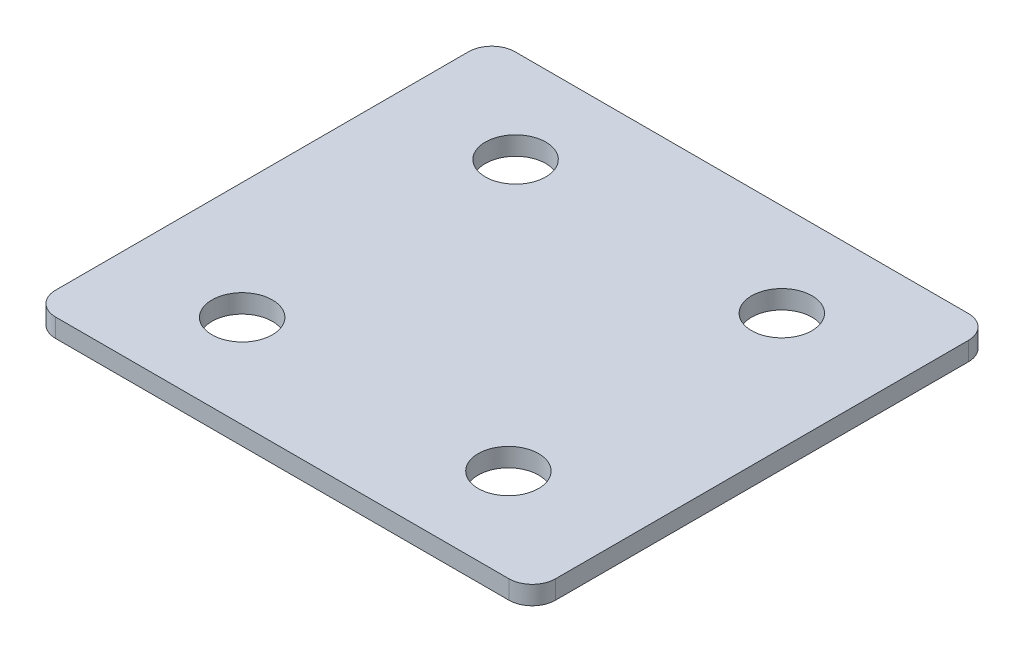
ISO-10303-21;
HEADER;
FILE_DESCRIPTION(('STEP AP214'),'2;1');
FILE_NAME('part.step','',(''),(''),'','','');
FILE_SCHEMA(('AUTOMOTIVE_DESIGN { 1 0 10303 214 1 1 1 1 }'));
ENDSEC;
DATA;
#1=APPLICATION_CONTEXT('core data for automotive mechanical design processes');
#2=APPLICATION_PROTOCOL_DEFINITION('international standard','automotive_design',2000,#1);
#3=PRODUCT_CONTEXT('',#1,'mechanical');
#4=PRODUCT('Part','Part','',(#3));
#5=PRODUCT_RELATED_PRODUCT_CATEGORY('part','',(#4));
#6=PRODUCT_DEFINITION_FORMATION('','',#4);
#7=PRODUCT_DEFINITION_CONTEXT('part definition',#1,'design');
#8=PRODUCT_DEFINITION('design','',#6,#7);
#9=PRODUCT_DEFINITION_SHAPE('','',#8);
#10=(LENGTH_UNIT() NAMED_UNIT(*) SI_UNIT(.MILLI.,.METRE.));
#11=(NAMED_UNIT(*) PLANE_ANGLE_UNIT() SI_UNIT($,.RADIAN.));
#12=(NAMED_UNIT(*) SI_UNIT($,.STERADIAN.) SOLID_ANGLE_UNIT());
#13=UNCERTAINTY_MEASURE_WITH_UNIT(LENGTH_MEASURE(1.E-05),#10,'distance_accuracy_value','');
#14=(GEOMETRIC_REPRESENTATION_CONTEXT(3) GLOBAL_UNCERTAINTY_ASSIGNED_CONTEXT((#13)) GLOBAL_UNIT_ASSIGNED_CONTEXT((#10,
#11,#12)) REPRESENTATION_CONTEXT('',''));
#15=CARTESIAN_POINT('',(0.,0.,0.));
#16=DIRECTION('',(0.,0.,1.));
#17=DIRECTION('',(1.,0.,0.));
#18=AXIS2_PLACEMENT_3D('',#15,#16,#17);
#19=CARTESIAN_POINT('',(-205.,-8.,-9.99999999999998));
#20=DIRECTION('',(0.,1.,0.));
#21=DIRECTION('',(0.,0.,1.));
#22=AXIS2_PLACEMENT_3D('',#19,#20,#21);
#23=CYLINDRICAL_SURFACE('',#22,10.);
#24=CARTESIAN_POINT('',(-205.,0.,-9.99999999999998));
#25=DIRECTION('',(0.,1.,0.));
#26=DIRECTION('',(0.,0.,-1.));
#27=AXIS2_PLACEMENT_3D('',#24,#25,#26);
#28=CIRCLE('',#27,10.);
#29=CARTESIAN_POINT('',(-215.,0.,-10.));
#30=VERTEX_POINT('',#29);
#31=CARTESIAN_POINT('',(-205.,0.,0.));
#32=VERTEX_POINT('',#31);
#33=EDGE_CURVE('E148',#30,#32,#28,.T.);
#34=ORIENTED_EDGE('',*,*,#33,.F.);
#35=DIRECTION('',(0.,1.,0.));
#36=VECTOR('',#35,1.);
#37=CARTESIAN_POINT('',(-215.,-8.,-10.));
#38=LINE('',#37,#36);
#39=CARTESIAN_POINT('',(-215.,-8.,-10.));
#40=VERTEX_POINT('',#39);
#41=EDGE_CURVE('E11',#40,#30,#38,.T.);
#42=ORIENTED_EDGE('',*,*,#41,.F.);
#43=CARTESIAN_POINT('',(-205.,-8.,-9.99999999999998));
#44=DIRECTION('',(0.,1.,0.));
#45=DIRECTION('',(0.,0.,-1.));
#46=AXIS2_PLACEMENT_3D('',#43,#44,#45);
#47=CIRCLE('',#46,10.);
#48=CARTESIAN_POINT('',(-205.,-8.,0.));
#49=VERTEX_POINT('',#48);
#50=EDGE_CURVE('E174',#40,#49,#47,.T.);
#51=ORIENTED_EDGE('',*,*,#50,.T.);
#52=DIRECTION('',(0.,1.,0.));
#53=VECTOR('',#52,1.);
#54=CARTESIAN_POINT('',(-205.,-8.,0.));
#55=LINE('',#54,#53);
#56=EDGE_CURVE('E99',#49,#32,#55,.T.);
#57=ORIENTED_EDGE('',*,*,#56,.T.);
#58=EDGE_LOOP('',(#34,#42,#51,#57));
#59=FACE_BOUND('',#58,.T.);
#60=ADVANCED_FACE('F42',(#59),#23,.T.);
#61=CARTESIAN_POINT('',(-215.,-8.,-10.));
#62=DIRECTION('',(-1.,0.,0.));
#63=DIRECTION('',(0.,0.,1.));
#64=AXIS2_PLACEMENT_3D('',#61,#62,#63);
#65=PLANE('',#64);
#66=DIRECTION('',(0.,0.,1.));
#67=VECTOR('',#66,1.);
#68=CARTESIAN_POINT('',(-215.,0.,-10.));
#69=LINE('',#68,#67);
#70=CARTESIAN_POINT('',(-215.,0.,-187.59));
#71=VERTEX_POINT('',#70);
#72=EDGE_CURVE('E171',#71,#30,#69,.T.);
#73=ORIENTED_EDGE('',*,*,#72,.F.);
#74=DIRECTION('',(0.,1.,0.));
#75=VECTOR('',#74,1.);
#76=CARTESIAN_POINT('',(-215.,-8.,-187.59));
#77=LINE('',#76,#75);
#78=CARTESIAN_POINT('',(-215.,-8.,-187.59));
#79=VERTEX_POINT('',#78);
#80=EDGE_CURVE('E52',#79,#71,#77,.T.);
#81=ORIENTED_EDGE('',*,*,#80,.F.);
#82=DIRECTION('',(0.,0.,1.));
#83=VECTOR('',#82,1.);
#84=CARTESIAN_POINT('',(-215.,-8.,-10.));
#85=LINE('',#84,#83);
#86=EDGE_CURVE('E132',#79,#40,#85,.T.);
#87=ORIENTED_EDGE('',*,*,#86,.T.);
#88=ORIENTED_EDGE('',*,*,#41,.T.);
#89=EDGE_LOOP('',(#73,#81,#87,#88));
#90=FACE_BOUND('',#89,.T.);
#91=ADVANCED_FACE('F224',(#90),#65,.T.);
#92=CARTESIAN_POINT('',(-205.,-8.,-187.59));
#93=DIRECTION('',(0.,1.,0.));
#94=DIRECTION('',(0.,0.,1.));
#95=AXIS2_PLACEMENT_3D('',#92,#93,#94);
#96=CYLINDRICAL_SURFACE('',#95,10.);
#97=CARTESIAN_POINT('',(-205.,0.,-187.59));
#98=DIRECTION('',(0.,1.,0.));
#99=DIRECTION('',(0.,0.,1.));
#100=AXIS2_PLACEMENT_3D('',#97,#98,#99);
#101=CIRCLE('',#100,10.);
#102=CARTESIAN_POINT('',(-205.,0.,-197.59));
#103=VERTEX_POINT('',#102);
#104=EDGE_CURVE('E118',#103,#71,#101,.T.);
#105=ORIENTED_EDGE('',*,*,#104,.F.);
#106=DIRECTION('',(0.,1.,0.));
#107=VECTOR('',#106,1.);
#108=CARTESIAN_POINT('',(-205.,-8.,-197.59));
#109=LINE('',#108,#107);
#110=CARTESIAN_POINT('',(-205.,-8.,-197.59));
#111=VERTEX_POINT('',#110);
#112=EDGE_CURVE('E113',#111,#103,#109,.T.);
#113=ORIENTED_EDGE('',*,*,#112,.F.);
#114=CARTESIAN_POINT('',(-205.,-8.,-187.59));
#115=DIRECTION('',(0.,1.,0.));
#116=DIRECTION('',(0.,0.,1.));
#117=AXIS2_PLACEMENT_3D('',#114,#115,#116);
#118=CIRCLE('',#117,10.);
#119=EDGE_CURVE('E116',#111,#79,#118,.T.);
#120=ORIENTED_EDGE('',*,*,#119,.T.);
#121=ORIENTED_EDGE('',*,*,#80,.T.);
#122=EDGE_LOOP('',(#105,#113,#120,#121));
#123=FACE_BOUND('',#122,.T.);
#124=ADVANCED_FACE('F115',(#123),#96,.T.);
#125=CARTESIAN_POINT('',(-10.0000000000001,-8.,-197.59));
#126=DIRECTION('',(0.,0.,-1.));
#127=DIRECTION('',(-1.,0.,0.));
#128=AXIS2_PLACEMENT_3D('',#125,#126,#127);
#129=PLANE('',#128);
#130=DIRECTION('',(-1.,0.,0.));
#131=VECTOR('',#130,1.);
#132=CARTESIAN_POINT('',(-10.0000000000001,0.,-197.59));
#133=LINE('',#132,#131);
#134=CARTESIAN_POINT('',(-10.0000000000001,0.,-197.59));
#135=VERTEX_POINT('',#134);
#136=EDGE_CURVE('E167',#135,#103,#133,.T.);
#137=ORIENTED_EDGE('',*,*,#136,.F.);
#138=DIRECTION('',(0.,1.,0.));
#139=VECTOR('',#138,1.);
#140=CARTESIAN_POINT('',(-10.0000000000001,-8.,-197.59));
#141=LINE('',#140,#139);
#142=CARTESIAN_POINT('',(-10.0000000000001,-8.,-197.59));
#143=VERTEX_POINT('',#142);
#144=EDGE_CURVE('E124',#143,#135,#141,.T.);
#145=ORIENTED_EDGE('',*,*,#144,.F.);
#146=DIRECTION('',(-1.,0.,0.));
#147=VECTOR('',#146,1.);
#148=CARTESIAN_POINT('',(-10.0000000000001,-8.,-197.59));
#149=LINE('',#148,#147);
#150=EDGE_CURVE('E130',#143,#111,#149,.T.);
#151=ORIENTED_EDGE('',*,*,#150,.T.);
#152=ORIENTED_EDGE('',*,*,#112,.T.);
#153=EDGE_LOOP('',(#137,#145,#151,#152));
#154=FACE_BOUND('',#153,.T.);
#155=ADVANCED_FACE('F135',(#154),#129,.T.);
#156=CARTESIAN_POINT('',(-10.,-8.,-187.59));
#157=DIRECTION('',(0.,1.,0.));
#158=DIRECTION('',(0.,0.,1.));
#159=AXIS2_PLACEMENT_3D('',#156,#157,#158);
#160=CYLINDRICAL_SURFACE('',#159,10.);
#161=CARTESIAN_POINT('',(-10.,0.,-187.59));
#162=DIRECTION('',(0.,1.,0.));
#163=DIRECTION('',(0.,0.,1.));
#164=AXIS2_PLACEMENT_3D('',#161,#162,#163);
#165=CIRCLE('',#164,10.);
#166=CARTESIAN_POINT('',(0.,0.,-187.59));
#167=VERTEX_POINT('',#166);
#168=EDGE_CURVE('E163',#167,#135,#165,.T.);
#169=ORIENTED_EDGE('',*,*,#168,.F.);
#170=DIRECTION('',(0.,1.,0.));
#171=VECTOR('',#170,1.);
#172=CARTESIAN_POINT('',(0.,-8.,-187.59));
#173=LINE('',#172,#171);
#174=CARTESIAN_POINT('',(0.,-8.,-187.59));
#175=VERTEX_POINT('',#174);
#176=EDGE_CURVE('E180',#175,#167,#173,.T.);
#177=ORIENTED_EDGE('',*,*,#176,.F.);
#178=CARTESIAN_POINT('',(-10.,-8.,-187.59));
#179=DIRECTION('',(0.,1.,0.));
#180=DIRECTION('',(0.,0.,1.));
#181=AXIS2_PLACEMENT_3D('',#178,#179,#180);
#182=CIRCLE('',#181,10.);
#183=EDGE_CURVE('E137',#175,#143,#182,.T.);
#184=ORIENTED_EDGE('',*,*,#183,.T.);
#185=ORIENTED_EDGE('',*,*,#144,.T.);
#186=EDGE_LOOP('',(#169,#177,#184,#185));
#187=FACE_BOUND('',#186,.T.);
#188=ADVANCED_FACE('F233',(#187),#160,.T.);
#189=CARTESIAN_POINT('',(0.,-8.,-10.0000000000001));
#190=DIRECTION('',(1.,0.,0.));
#191=DIRECTION('',(0.,0.,-1.));
#192=AXIS2_PLACEMENT_3D('',#189,#190,#191);
#193=PLANE('',#192);
#194=DIRECTION('',(0.,0.,-1.));
#195=VECTOR('',#194,1.);
#196=CARTESIAN_POINT('',(0.,0.,-10.0000000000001));
#197=LINE('',#196,#195);
#198=CARTESIAN_POINT('',(0.,0.,-10.0000000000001));
#199=VERTEX_POINT('',#198);
#200=EDGE_CURVE('E159',#199,#167,#197,.T.);
#201=ORIENTED_EDGE('',*,*,#200,.F.);
#202=DIRECTION('',(0.,1.,0.));
#203=VECTOR('',#202,1.);
#204=CARTESIAN_POINT('',(0.,-8.,-10.0000000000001));
#205=LINE('',#204,#203);
#206=CARTESIAN_POINT('',(0.,-8.,-10.0000000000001));
#207=VERTEX_POINT('',#206);
#208=EDGE_CURVE('E183',#207,#199,#205,.T.);
#209=ORIENTED_EDGE('',*,*,#208,.F.);
#210=DIRECTION('',(0.,0.,-1.));
#211=VECTOR('',#210,1.);
#212=CARTESIAN_POINT('',(0.,-8.,-10.0000000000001));
#213=LINE('',#212,#211);
#214=EDGE_CURVE('E142',#207,#175,#213,.T.);
#215=ORIENTED_EDGE('',*,*,#214,.T.);
#216=ORIENTED_EDGE('',*,*,#176,.T.);
#217=EDGE_LOOP('',(#201,#209,#215,#216));
#218=FACE_BOUND('',#217,.T.);
#219=ADVANCED_FACE('F239',(#218),#193,.T.);
#220=CARTESIAN_POINT('',(-10.,-8.,-10.));
#221=DIRECTION('',(0.,1.,0.));
#222=DIRECTION('',(0.,0.,1.));
#223=AXIS2_PLACEMENT_3D('',#220,#221,#222);
#224=CYLINDRICAL_SURFACE('',#223,10.);
#225=CARTESIAN_POINT('',(-10.,0.,-10.));
#226=DIRECTION('',(0.,1.,0.));
#227=DIRECTION('',(0.,0.,1.));
#228=AXIS2_PLACEMENT_3D('',#225,#226,#227);
#229=CIRCLE('',#228,10.);
#230=CARTESIAN_POINT('',(-10.0000000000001,0.,0.));
#231=VERTEX_POINT('',#230);
#232=EDGE_CURVE('E156',#231,#199,#229,.T.);
#233=ORIENTED_EDGE('',*,*,#232,.F.);
#234=DIRECTION('',(0.,1.,0.));
#235=VECTOR('',#234,1.);
#236=CARTESIAN_POINT('',(-10.0000000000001,-8.,0.));
#237=LINE('',#236,#235);
#238=CARTESIAN_POINT('',(-10.0000000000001,-8.,0.));
#239=VERTEX_POINT('',#238);
#240=EDGE_CURVE('E186',#239,#231,#237,.T.);
#241=ORIENTED_EDGE('',*,*,#240,.F.);
#242=CARTESIAN_POINT('',(-10.,-8.,-10.));
#243=DIRECTION('',(0.,1.,0.));
#244=DIRECTION('',(0.,0.,1.));
#245=AXIS2_PLACEMENT_3D('',#242,#243,#244);
#246=CIRCLE('',#245,10.);
#247=EDGE_CURVE('E241',#239,#207,#246,.T.);
#248=ORIENTED_EDGE('',*,*,#247,.T.);
#249=ORIENTED_EDGE('',*,*,#208,.T.);
#250=EDGE_LOOP('',(#233,#241,#248,#249));
#251=FACE_BOUND('',#250,.T.);
#252=ADVANCED_FACE('F292',(#251),#224,.T.);
#253=CARTESIAN_POINT('',(-10.0000000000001,-8.,0.));
#254=DIRECTION('',(0.,0.,1.));
#255=DIRECTION('',(1.,0.,0.));
#256=AXIS2_PLACEMENT_3D('',#253,#254,#255);
#257=PLANE('',#256);
#258=DIRECTION('',(1.,0.,0.));
#259=VECTOR('',#258,1.);
#260=CARTESIAN_POINT('',(-10.0000000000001,0.,0.));
#261=LINE('',#260,#259);
#262=EDGE_CURVE('E152',#32,#231,#261,.T.);
#263=ORIENTED_EDGE('',*,*,#262,.F.);
#264=ORIENTED_EDGE('',*,*,#56,.F.);
#265=DIRECTION('',(1.,0.,0.));
#266=VECTOR('',#265,1.);
#267=CARTESIAN_POINT('',(-10.0000000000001,-8.,0.));
#268=LINE('',#267,#266);
#269=EDGE_CURVE('E244',#49,#239,#268,.T.);
#270=ORIENTED_EDGE('',*,*,#269,.T.);
#271=ORIENTED_EDGE('',*,*,#240,.T.);
#272=EDGE_LOOP('',(#263,#264,#270,#271));
#273=FACE_BOUND('',#272,.T.);
#274=ADVANCED_FACE('F269',(#273),#257,.T.);
#275=CARTESIAN_POINT('',(-205.,-8.,-9.99999999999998));
#276=DIRECTION('',(0.,-1.,0.));
#277=DIRECTION('',(0.,0.,-1.));
#278=AXIS2_PLACEMENT_3D('',#275,#276,#277);
#279=PLANE('',#278);
#280=CARTESIAN_POINT('',(-164.75,-8.,-157.585786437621));
#281=DIRECTION('',(0.,-1.,0.));
#282=DIRECTION('',(0.,0.,-1.));
#283=AXIS2_PLACEMENT_3D('',#280,#281,#282);
#284=CIRCLE('',#283,13.);
#285=CARTESIAN_POINT('',(-164.75,-8.,-170.585786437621));
#286=VERTEX_POINT('',#285);
#287=EDGE_CURVE('E255',#286,#286,#284,.T.);
#288=ORIENTED_EDGE('',*,*,#287,.F.);
#289=EDGE_LOOP('',(#288));
#290=FACE_BOUND('',#289,.T.);
#291=CARTESIAN_POINT('',(-164.75,-8.,-39.999999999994));
#292=DIRECTION('',(0.,-1.,0.));
#293=DIRECTION('',(0.,0.,-1.));
#294=AXIS2_PLACEMENT_3D('',#291,#292,#293);
#295=CIRCLE('',#294,13.);
#296=CARTESIAN_POINT('',(-164.75,-8.,-52.999999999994));
#297=VERTEX_POINT('',#296);
#298=EDGE_CURVE('E257',#297,#297,#295,.T.);
#299=ORIENTED_EDGE('',*,*,#298,.F.);
#300=EDGE_LOOP('',(#299));
#301=FACE_BOUND('',#300,.T.);
#302=CARTESIAN_POINT('',(-50.2499999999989,-8.,-39.999999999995));
#303=DIRECTION('',(0.,-1.,0.));
#304=DIRECTION('',(0.,0.,-1.));
#305=AXIS2_PLACEMENT_3D('',#302,#303,#304);
#306=CIRCLE('',#305,13.);
#307=CARTESIAN_POINT('',(-50.2499999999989,-8.,-52.9999999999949));
#308=VERTEX_POINT('',#307);
#309=EDGE_CURVE('E254',#308,#308,#306,.T.);
#310=ORIENTED_EDGE('',*,*,#309,.F.);
#311=EDGE_LOOP('',(#310));
#312=FACE_BOUND('',#311,.T.);
#313=CARTESIAN_POINT('',(-50.2499999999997,-8.,-157.585786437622));
#314=DIRECTION('',(0.,-1.,0.));
#315=DIRECTION('',(0.,0.,-1.));
#316=AXIS2_PLACEMENT_3D('',#313,#314,#315);
#317=CIRCLE('',#316,13.);
#318=CARTESIAN_POINT('',(-50.2499999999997,-8.,-170.585786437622));
#319=VERTEX_POINT('',#318);
#320=EDGE_CURVE('E196',#319,#319,#317,.T.);
#321=ORIENTED_EDGE('',*,*,#320,.F.);
#322=EDGE_LOOP('',(#321));
#323=FACE_BOUND('',#322,.T.);
#324=ORIENTED_EDGE('',*,*,#50,.F.);
#325=ORIENTED_EDGE('',*,*,#86,.F.);
#326=ORIENTED_EDGE('',*,*,#119,.F.);
#327=ORIENTED_EDGE('',*,*,#150,.F.);
#328=ORIENTED_EDGE('',*,*,#183,.F.);
#329=ORIENTED_EDGE('',*,*,#214,.F.);
#330=ORIENTED_EDGE('',*,*,#247,.F.);
#331=ORIENTED_EDGE('',*,*,#269,.F.);
#332=EDGE_LOOP('',(#324,#325,#326,#327,#328,#329,#330,#331));
#333=FACE_BOUND('',#332,.T.);
#334=ADVANCED_FACE('F128',(#290,#301,#312,#323,#333),#279,.T.);
#335=CARTESIAN_POINT('',(-205.,0.,-9.99999999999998));
#336=DIRECTION('',(0.,-1.,0.));
#337=DIRECTION('',(0.,0.,-1.));
#338=AXIS2_PLACEMENT_3D('',#335,#336,#337);
#339=PLANE('',#338);
#340=CARTESIAN_POINT('',(-164.75,0.,-157.585786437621));
#341=DIRECTION('',(0.,-1.,0.));
#342=DIRECTION('',(0.,0.,-1.));
#343=AXIS2_PLACEMENT_3D('',#340,#341,#342);
#344=CIRCLE('',#343,13.);
#345=CARTESIAN_POINT('',(-164.75,0.,-170.585786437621));
#346=VERTEX_POINT('',#345);
#347=EDGE_CURVE('E45',#346,#346,#344,.T.);
#348=ORIENTED_EDGE('',*,*,#347,.T.);
#349=EDGE_LOOP('',(#348));
#350=FACE_BOUND('',#349,.T.);
#351=CARTESIAN_POINT('',(-164.75,0.,-39.999999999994));
#352=DIRECTION('',(0.,-1.,0.));
#353=DIRECTION('',(0.,0.,-1.));
#354=AXIS2_PLACEMENT_3D('',#351,#352,#353);
#355=CIRCLE('',#354,13.);
#356=CARTESIAN_POINT('',(-164.75,0.,-52.999999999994));
#357=VERTEX_POINT('',#356);
#358=EDGE_CURVE('E199',#357,#357,#355,.T.);
#359=ORIENTED_EDGE('',*,*,#358,.T.);
#360=EDGE_LOOP('',(#359));
#361=FACE_BOUND('',#360,.T.);
#362=CARTESIAN_POINT('',(-50.2499999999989,0.,-39.999999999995));
#363=DIRECTION('',(0.,-1.,0.));
#364=DIRECTION('',(0.,0.,-1.));
#365=AXIS2_PLACEMENT_3D('',#362,#363,#364);
#366=CIRCLE('',#365,13.);
#367=CARTESIAN_POINT('',(-50.2499999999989,0.,-52.9999999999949));
#368=VERTEX_POINT('',#367);
#369=EDGE_CURVE('E195',#368,#368,#366,.T.);
#370=ORIENTED_EDGE('',*,*,#369,.T.);
#371=EDGE_LOOP('',(#370));
#372=FACE_BOUND('',#371,.T.);
#373=CARTESIAN_POINT('',(-50.2499999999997,0.,-157.585786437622));
#374=DIRECTION('',(0.,-1.,0.));
#375=DIRECTION('',(0.,0.,-1.));
#376=AXIS2_PLACEMENT_3D('',#373,#374,#375);
#377=CIRCLE('',#376,13.);
#378=CARTESIAN_POINT('',(-50.2499999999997,0.,-170.585786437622));
#379=VERTEX_POINT('',#378);
#380=EDGE_CURVE('E191',#379,#379,#377,.T.);
#381=ORIENTED_EDGE('',*,*,#380,.T.);
#382=EDGE_LOOP('',(#381));
#383=FACE_BOUND('',#382,.T.);
#384=ORIENTED_EDGE('',*,*,#33,.T.);
#385=ORIENTED_EDGE('',*,*,#262,.T.);
#386=ORIENTED_EDGE('',*,*,#232,.T.);
#387=ORIENTED_EDGE('',*,*,#200,.T.);
#388=ORIENTED_EDGE('',*,*,#168,.T.);
#389=ORIENTED_EDGE('',*,*,#136,.T.);
#390=ORIENTED_EDGE('',*,*,#104,.T.);
#391=ORIENTED_EDGE('',*,*,#72,.T.);
#392=EDGE_LOOP('',(#384,#385,#386,#387,#388,#389,#390,#391));
#393=FACE_BOUND('',#392,.T.);
#394=ADVANCED_FACE('F208',(#350,#361,#372,#383,#393),#339,.F.);
#395=CARTESIAN_POINT('',(-50.2499999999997,2.,-157.585786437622));
#396=DIRECTION('',(0.,-1.,0.));
#397=DIRECTION('',(0.,0.,-1.));
#398=AXIS2_PLACEMENT_3D('',#395,#396,#397);
#399=CYLINDRICAL_SURFACE('',#398,13.);
#400=ORIENTED_EDGE('',*,*,#320,.T.);
#401=EDGE_LOOP('',(#400));
#402=FACE_BOUND('',#401,.T.);
#403=ORIENTED_EDGE('',*,*,#380,.F.);
#404=EDGE_LOOP('',(#403));
#405=FACE_BOUND('',#404,.T.);
#406=ADVANCED_FACE('F274',(#402,#405),#399,.F.);
#407=CARTESIAN_POINT('',(-50.2499999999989,2.,-39.999999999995));
#408=DIRECTION('',(0.,-1.,0.));
#409=DIRECTION('',(0.,0.,-1.));
#410=AXIS2_PLACEMENT_3D('',#407,#408,#409);
#411=CYLINDRICAL_SURFACE('',#410,13.);
#412=ORIENTED_EDGE('',*,*,#309,.T.);
#413=EDGE_LOOP('',(#412));
#414=FACE_BOUND('',#413,.T.);
#415=ORIENTED_EDGE('',*,*,#369,.F.);
#416=EDGE_LOOP('',(#415));
#417=FACE_BOUND('',#416,.T.);
#418=ADVANCED_FACE('F218',(#414,#417),#411,.F.);
#419=CARTESIAN_POINT('',(-164.75,2.,-39.999999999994));
#420=DIRECTION('',(0.,-1.,0.));
#421=DIRECTION('',(0.,0.,-1.));
#422=AXIS2_PLACEMENT_3D('',#419,#420,#421);
#423=CYLINDRICAL_SURFACE('',#422,13.);
#424=ORIENTED_EDGE('',*,*,#298,.T.);
#425=EDGE_LOOP('',(#424));
#426=FACE_BOUND('',#425,.T.);
#427=ORIENTED_EDGE('',*,*,#358,.F.);
#428=EDGE_LOOP('',(#427));
#429=FACE_BOUND('',#428,.T.);
#430=ADVANCED_FACE('F212',(#426,#429),#423,.F.);
#431=CARTESIAN_POINT('',(-164.75,2.,-157.585786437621));
#432=DIRECTION('',(0.,-1.,0.));
#433=DIRECTION('',(0.,0.,-1.));
#434=AXIS2_PLACEMENT_3D('',#431,#432,#433);
#435=CYLINDRICAL_SURFACE('',#434,13.);
#436=ORIENTED_EDGE('',*,*,#287,.T.);
#437=EDGE_LOOP('',(#436));
#438=FACE_BOUND('',#437,.T.);
#439=ORIENTED_EDGE('',*,*,#347,.F.);
#440=EDGE_LOOP('',(#439));
#441=FACE_BOUND('',#440,.T.);
#442=ADVANCED_FACE('F210',(#438,#441),#435,.F.);
#443=CLOSED_SHELL('',(#60,#91,#124,#155,#188,#219,#252,#274,#334,#394,#406,#418,#430,#442));
#444=MANIFOLD_SOLID_BREP('B2',#443);
#445=ADVANCED_BREP_SHAPE_REPRESENTATION('',(#18,#444),#14);
#446=SHAPE_DEFINITION_REPRESENTATION(#9,#445);
ENDSEC;
END-ISO-10303-21;
